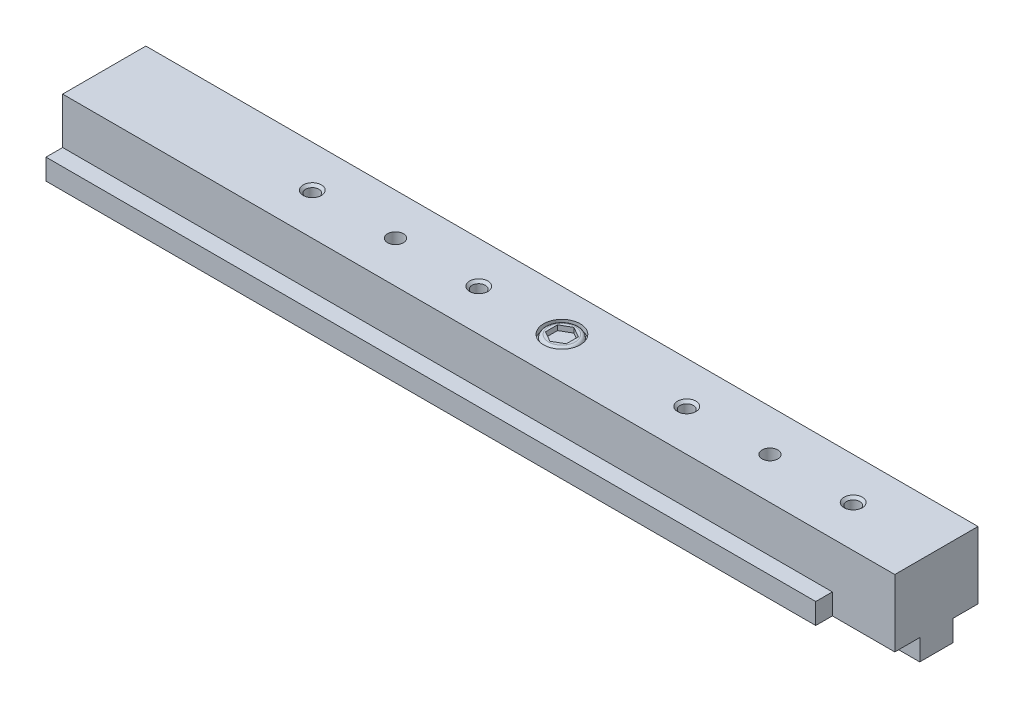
ISO-10303-21;
HEADER;
FILE_DESCRIPTION(('STEP AP214'),'2;1');
FILE_NAME('part.step','',(''),(''),'','','');
FILE_SCHEMA(('AUTOMOTIVE_DESIGN { 1 0 10303 214 1 1 1 1 }'));
ENDSEC;
DATA;
#1=APPLICATION_CONTEXT('core data for automotive mechanical design processes');
#2=APPLICATION_PROTOCOL_DEFINITION('international standard','automotive_design',2000,#1);
#3=PRODUCT_CONTEXT('',#1,'mechanical');
#4=PRODUCT('Part','Part','',(#3));
#5=PRODUCT_RELATED_PRODUCT_CATEGORY('part','',(#4));
#6=PRODUCT_DEFINITION_FORMATION('','',#4);
#7=PRODUCT_DEFINITION_CONTEXT('part definition',#1,'design');
#8=PRODUCT_DEFINITION('design','',#6,#7);
#9=PRODUCT_DEFINITION_SHAPE('','',#8);
#10=(LENGTH_UNIT() NAMED_UNIT(*) SI_UNIT(.MILLI.,.METRE.));
#11=(NAMED_UNIT(*) PLANE_ANGLE_UNIT() SI_UNIT($,.RADIAN.));
#12=(NAMED_UNIT(*) SI_UNIT($,.STERADIAN.) SOLID_ANGLE_UNIT());
#13=UNCERTAINTY_MEASURE_WITH_UNIT(LENGTH_MEASURE(1.E-05),#10,'distance_accuracy_value','');
#14=(GEOMETRIC_REPRESENTATION_CONTEXT(3) GLOBAL_UNCERTAINTY_ASSIGNED_CONTEXT((#13)) GLOBAL_UNIT_ASSIGNED_CONTEXT((#10,
#11,#12)) REPRESENTATION_CONTEXT('',''));
#15=CARTESIAN_POINT('',(0.,0.,0.));
#16=DIRECTION('',(0.,0.,1.));
#17=DIRECTION('',(1.,0.,0.));
#18=AXIS2_PLACEMENT_3D('',#15,#16,#17);
#19=CARTESIAN_POINT('',(69.85,12.7,0.));
#20=DIRECTION('',(0.,1.,0.));
#21=DIRECTION('',(0.,0.,1.));
#22=AXIS2_PLACEMENT_3D('',#19,#20,#21);
#23=PLANE('',#22);
#24=CARTESIAN_POINT('',(69.85,12.7,0.));
#25=DIRECTION('',(0.,1.,0.));
#26=DIRECTION('',(0.,0.,1.));
#27=AXIS2_PLACEMENT_3D('',#24,#25,#26);
#28=CIRCLE('',#27,2.794);
#29=CARTESIAN_POINT('',(69.85,12.7,2.794));
#30=VERTEX_POINT('',#29);
#31=EDGE_CURVE('E244',#30,#30,#28,.T.);
#32=ORIENTED_EDGE('',*,*,#31,.T.);
#33=EDGE_LOOP('',(#32));
#34=FACE_BOUND('',#33,.T.);
#35=CARTESIAN_POINT('',(69.85,12.7,0.));
#36=DIRECTION('',(0.,1.,0.));
#37=DIRECTION('',(0.,0.,1.));
#38=AXIS2_PLACEMENT_3D('',#35,#36,#37);
#39=CIRCLE('',#38,2.54);
#40=CARTESIAN_POINT('',(69.85,12.7,2.54));
#41=VERTEX_POINT('',#40);
#42=EDGE_CURVE('E37',#41,#41,#39,.F.);
#43=ORIENTED_EDGE('',*,*,#42,.T.);
#44=EDGE_LOOP('',(#43));
#45=FACE_BOUND('',#44,.T.);
#46=ADVANCED_FACE('F33',(#34,#45),#23,.T.);
#47=CARTESIAN_POINT('',(117.475,13.462,-6.35));
#48=DIRECTION('',(0.,-1.,0.));
#49=DIRECTION('',(0.,0.,-1.));
#50=AXIS2_PLACEMENT_3D('',#47,#48,#49);
#51=PLANE('',#50);
#52=CARTESIAN_POINT('',(69.85,13.462,0.));
#53=DIRECTION('',(0.,1.,0.));
#54=DIRECTION('',(0.,0.,1.));
#55=AXIS2_PLACEMENT_3D('',#52,#53,#54);
#56=CIRCLE('',#55,2.794);
#57=CARTESIAN_POINT('',(69.85,13.462,2.794));
#58=VERTEX_POINT('',#57);
#59=EDGE_CURVE('E248',#58,#58,#56,.T.);
#60=ORIENTED_EDGE('',*,*,#59,.F.);
#61=EDGE_LOOP('',(#60));
#62=FACE_BOUND('',#61,.T.);
#63=CARTESIAN_POINT('',(44.45,13.462,0.));
#64=DIRECTION('',(0.,1.,0.));
#65=DIRECTION('',(0.,0.,1.));
#66=AXIS2_PLACEMENT_3D('',#63,#64,#65);
#67=CIRCLE('',#66,1.20269);
#68=CARTESIAN_POINT('',(44.45,13.462,1.20269));
#69=VERTEX_POINT('',#68);
#70=EDGE_CURVE('E247',#69,#69,#67,.T.);
#71=ORIENTED_EDGE('',*,*,#70,.F.);
#72=EDGE_LOOP('',(#71));
#73=FACE_BOUND('',#72,.T.);
#74=CARTESIAN_POINT('',(101.6,13.462,0.));
#75=DIRECTION('',(0.,1.,0.));
#76=DIRECTION('',(0.,0.,1.));
#77=AXIS2_PLACEMENT_3D('',#74,#75,#76);
#78=CIRCLE('',#77,1.20269000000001);
#79=CARTESIAN_POINT('',(101.6,13.462,1.20269000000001));
#80=VERTEX_POINT('',#79);
#81=EDGE_CURVE('E254',#80,#80,#78,.T.);
#82=ORIENTED_EDGE('',*,*,#81,.F.);
#83=EDGE_LOOP('',(#82));
#84=FACE_BOUND('',#83,.T.);
#85=CARTESIAN_POINT('',(88.9,13.462,0.));
#86=DIRECTION('',(0.,1.,0.));
#87=DIRECTION('',(0.,0.,1.));
#88=AXIS2_PLACEMENT_3D('',#85,#86,#87);
#89=CIRCLE('',#88,1.397);
#90=CARTESIAN_POINT('',(88.9,13.462,1.397));
#91=VERTEX_POINT('',#90);
#92=EDGE_CURVE('E277',#91,#91,#89,.T.);
#93=ORIENTED_EDGE('',*,*,#92,.F.);
#94=EDGE_LOOP('',(#93));
#95=FACE_BOUND('',#94,.T.);
#96=CARTESIAN_POINT('',(114.3,13.462,0.));
#97=DIRECTION('',(0.,1.,0.));
#98=DIRECTION('',(0.,0.,1.));
#99=AXIS2_PLACEMENT_3D('',#96,#97,#98);
#100=CIRCLE('',#99,1.397);
#101=CARTESIAN_POINT('',(114.3,13.462,1.397));
#102=VERTEX_POINT('',#101);
#103=EDGE_CURVE('E295',#102,#102,#100,.T.);
#104=ORIENTED_EDGE('',*,*,#103,.F.);
#105=EDGE_LOOP('',(#104));
#106=FACE_BOUND('',#105,.T.);
#107=DIRECTION('',(0.,0.,1.));
#108=VECTOR('',#107,1.);
#109=CARTESIAN_POINT('',(0.,13.462,-6.35));
#110=LINE('',#109,#108);
#111=CARTESIAN_POINT('',(0.,13.462,-6.35));
#112=VERTEX_POINT('',#111);
#113=CARTESIAN_POINT('',(0.,13.462,6.35));
#114=VERTEX_POINT('',#113);
#115=EDGE_CURVE('E423',#112,#114,#110,.T.);
#116=ORIENTED_EDGE('',*,*,#115,.T.);
#117=DIRECTION('',(-1.,0.,0.));
#118=VECTOR('',#117,1.);
#119=CARTESIAN_POINT('',(117.475,13.462,6.35));
#120=LINE('',#119,#118);
#121=CARTESIAN_POINT('',(127.,13.462,6.35));
#122=VERTEX_POINT('',#121);
#123=EDGE_CURVE('E357',#122,#114,#120,.T.);
#124=ORIENTED_EDGE('',*,*,#123,.F.);
#125=DIRECTION('',(0.,0.,1.));
#126=VECTOR('',#125,1.);
#127=CARTESIAN_POINT('',(127.,13.462,-6.35));
#128=LINE('',#127,#126);
#129=CARTESIAN_POINT('',(127.,13.462,-6.35));
#130=VERTEX_POINT('',#129);
#131=EDGE_CURVE('E318',#130,#122,#128,.T.);
#132=ORIENTED_EDGE('',*,*,#131,.F.);
#133=DIRECTION('',(-1.,0.,0.));
#134=VECTOR('',#133,1.);
#135=CARTESIAN_POINT('',(117.475,13.462,-6.35));
#136=LINE('',#135,#134);
#137=EDGE_CURVE('E341',#130,#112,#136,.T.);
#138=ORIENTED_EDGE('',*,*,#137,.T.);
#139=EDGE_LOOP('',(#116,#124,#132,#138));
#140=FACE_BOUND('',#139,.T.);
#141=CARTESIAN_POINT('',(31.75,13.462,0.));
#142=DIRECTION('',(0.,1.,0.));
#143=DIRECTION('',(0.,0.,1.));
#144=AXIS2_PLACEMENT_3D('',#141,#142,#143);
#145=CIRCLE('',#144,1.397);
#146=CARTESIAN_POINT('',(31.75,13.462,1.397));
#147=VERTEX_POINT('',#146);
#148=EDGE_CURVE('E286',#147,#147,#145,.T.);
#149=ORIENTED_EDGE('',*,*,#148,.F.);
#150=EDGE_LOOP('',(#149));
#151=FACE_BOUND('',#150,.T.);
#152=CARTESIAN_POINT('',(57.15,13.462,0.));
#153=DIRECTION('',(0.,1.,0.));
#154=DIRECTION('',(0.,0.,1.));
#155=AXIS2_PLACEMENT_3D('',#152,#153,#154);
#156=CIRCLE('',#155,1.397);
#157=CARTESIAN_POINT('',(57.15,13.462,1.397));
#158=VERTEX_POINT('',#157);
#159=EDGE_CURVE('E268',#158,#158,#156,.T.);
#160=ORIENTED_EDGE('',*,*,#159,.F.);
#161=EDGE_LOOP('',(#160));
#162=FACE_BOUND('',#161,.T.);
#163=ADVANCED_FACE('F451',(#62,#73,#84,#95,#106,#140,#151,#162),#51,.F.);
#164=CARTESIAN_POINT('',(117.475,3.2258,8.89));
#165=DIRECTION('',(1.,0.,0.));
#166=DIRECTION('',(0.,0.,-1.));
#167=AXIS2_PLACEMENT_3D('',#164,#165,#166);
#168=PLANE('',#167);
#169=DIRECTION('',(0.,-1.,0.));
#170=VECTOR('',#169,1.);
#171=CARTESIAN_POINT('',(117.475,13.462,6.35));
#172=LINE('',#171,#170);
#173=CARTESIAN_POINT('',(117.475,6.4008,6.35));
#174=VERTEX_POINT('',#173);
#175=CARTESIAN_POINT('',(117.475,3.2258,6.35));
#176=VERTEX_POINT('',#175);
#177=EDGE_CURVE('E11',#174,#176,#172,.T.);
#178=ORIENTED_EDGE('',*,*,#177,.F.);
#179=DIRECTION('',(0.,0.,1.));
#180=VECTOR('',#179,1.);
#181=CARTESIAN_POINT('',(117.475,6.4008,6.35));
#182=LINE('',#181,#180);
#183=CARTESIAN_POINT('',(117.475,6.4008,8.89));
#184=VERTEX_POINT('',#183);
#185=EDGE_CURVE('E333',#174,#184,#182,.T.);
#186=ORIENTED_EDGE('',*,*,#185,.T.);
#187=DIRECTION('',(0.,-1.,0.));
#188=VECTOR('',#187,1.);
#189=CARTESIAN_POINT('',(117.475,6.4008,8.89));
#190=LINE('',#189,#188);
#191=CARTESIAN_POINT('',(117.475,3.2258,8.89));
#192=VERTEX_POINT('',#191);
#193=EDGE_CURVE('E400',#184,#192,#190,.T.);
#194=ORIENTED_EDGE('',*,*,#193,.T.);
#195=DIRECTION('',(0.,0.,-1.));
#196=VECTOR('',#195,1.);
#197=CARTESIAN_POINT('',(117.475,3.2258,8.89));
#198=LINE('',#197,#196);
#199=EDGE_CURVE('E398',#192,#176,#198,.T.);
#200=ORIENTED_EDGE('',*,*,#199,.T.);
#201=EDGE_LOOP('',(#178,#186,#194,#200));
#202=FACE_BOUND('',#201,.T.);
#203=ADVANCED_FACE('F431',(#202),#168,.T.);
#204=CARTESIAN_POINT('',(117.475,6.4008,8.89));
#205=DIRECTION('',(0.,0.,-1.));
#206=DIRECTION('',(-1.,0.,0.));
#207=AXIS2_PLACEMENT_3D('',#204,#205,#206);
#208=PLANE('',#207);
#209=DIRECTION('',(0.,-1.,0.));
#210=VECTOR('',#209,1.);
#211=CARTESIAN_POINT('',(0.,6.4008,8.89));
#212=LINE('',#211,#210);
#213=CARTESIAN_POINT('',(0.,6.4008,8.89));
#214=VERTEX_POINT('',#213);
#215=CARTESIAN_POINT('',(0.,3.2258,8.89));
#216=VERTEX_POINT('',#215);
#217=EDGE_CURVE('E351',#214,#216,#212,.T.);
#218=ORIENTED_EDGE('',*,*,#217,.T.);
#219=DIRECTION('',(-1.,0.,0.));
#220=VECTOR('',#219,1.);
#221=CARTESIAN_POINT('',(117.475,3.2258,8.89));
#222=LINE('',#221,#220);
#223=EDGE_CURVE('E42',#192,#216,#222,.T.);
#224=ORIENTED_EDGE('',*,*,#223,.F.);
#225=ORIENTED_EDGE('',*,*,#193,.F.);
#226=DIRECTION('',(-1.,0.,0.));
#227=VECTOR('',#226,1.);
#228=CARTESIAN_POINT('',(117.475,6.4008,8.89));
#229=LINE('',#228,#227);
#230=EDGE_CURVE('E358',#184,#214,#229,.T.);
#231=ORIENTED_EDGE('',*,*,#230,.T.);
#232=EDGE_LOOP('',(#218,#224,#225,#231));
#233=FACE_BOUND('',#232,.T.);
#234=ADVANCED_FACE('F35',(#233),#208,.F.);
#235=CARTESIAN_POINT('',(117.475,3.2258,8.89));
#236=DIRECTION('',(0.,1.,0.));
#237=DIRECTION('',(0.,0.,1.));
#238=AXIS2_PLACEMENT_3D('',#235,#236,#237);
#239=PLANE('',#238);
#240=DIRECTION('',(0.,0.,-1.));
#241=VECTOR('',#240,1.);
#242=CARTESIAN_POINT('',(0.,3.2258,8.89));
#243=LINE('',#242,#241);
#244=CARTESIAN_POINT('',(0.,3.2258,2.54));
#245=VERTEX_POINT('',#244);
#246=EDGE_CURVE('E407',#216,#245,#243,.T.);
#247=ORIENTED_EDGE('',*,*,#246,.T.);
#248=DIRECTION('',(-1.,0.,0.));
#249=VECTOR('',#248,1.);
#250=CARTESIAN_POINT('',(117.475,3.2258,2.54));
#251=LINE('',#250,#249);
#252=CARTESIAN_POINT('',(127.,3.2258,2.54));
#253=VERTEX_POINT('',#252);
#254=EDGE_CURVE('E394',#253,#245,#251,.T.);
#255=ORIENTED_EDGE('',*,*,#254,.F.);
#256=DIRECTION('',(0.,0.,-1.));
#257=VECTOR('',#256,1.);
#258=CARTESIAN_POINT('',(127.,3.2258,6.35));
#259=LINE('',#258,#257);
#260=CARTESIAN_POINT('',(127.,3.2258,6.35));
#261=VERTEX_POINT('',#260);
#262=EDGE_CURVE('E301',#261,#253,#259,.T.);
#263=ORIENTED_EDGE('',*,*,#262,.F.);
#264=DIRECTION('',(-1.,0.,0.));
#265=VECTOR('',#264,1.);
#266=CARTESIAN_POINT('',(127.,3.2258,6.35));
#267=LINE('',#266,#265);
#268=EDGE_CURVE('E346',#261,#176,#267,.T.);
#269=ORIENTED_EDGE('',*,*,#268,.T.);
#270=ORIENTED_EDGE('',*,*,#199,.F.);
#271=ORIENTED_EDGE('',*,*,#223,.T.);
#272=EDGE_LOOP('',(#247,#255,#263,#269,#270,#271));
#273=FACE_BOUND('',#272,.T.);
#274=ADVANCED_FACE('F433',(#273),#239,.F.);
#275=CARTESIAN_POINT('',(117.475,3.2258,2.54));
#276=DIRECTION('',(0.,0.,-1.));
#277=DIRECTION('',(-1.,0.,0.));
#278=AXIS2_PLACEMENT_3D('',#275,#276,#277);
#279=PLANE('',#278);
#280=DIRECTION('',(0.,-1.,0.));
#281=VECTOR('',#280,1.);
#282=CARTESIAN_POINT('',(0.,3.2258,2.54));
#283=LINE('',#282,#281);
#284=CARTESIAN_POINT('',(0.,0.,2.54));
#285=VERTEX_POINT('',#284);
#286=EDGE_CURVE('E409',#245,#285,#283,.T.);
#287=ORIENTED_EDGE('',*,*,#286,.T.);
#288=DIRECTION('',(-1.,0.,0.));
#289=VECTOR('',#288,1.);
#290=CARTESIAN_POINT('',(117.475,0.,2.54));
#291=LINE('',#290,#289);
#292=CARTESIAN_POINT('',(127.,0.,2.54));
#293=VERTEX_POINT('',#292);
#294=EDGE_CURVE('E391',#293,#285,#291,.T.);
#295=ORIENTED_EDGE('',*,*,#294,.F.);
#296=DIRECTION('',(0.,-1.,0.));
#297=VECTOR('',#296,1.);
#298=CARTESIAN_POINT('',(127.,3.2258,2.54));
#299=LINE('',#298,#297);
#300=EDGE_CURVE('E304',#253,#293,#299,.T.);
#301=ORIENTED_EDGE('',*,*,#300,.F.);
#302=ORIENTED_EDGE('',*,*,#254,.T.);
#303=EDGE_LOOP('',(#287,#295,#301,#302));
#304=FACE_BOUND('',#303,.T.);
#305=ADVANCED_FACE('F543',(#304),#279,.F.);
#306=CARTESIAN_POINT('',(117.475,0.,2.54));
#307=DIRECTION('',(0.,1.,0.));
#308=DIRECTION('',(0.,0.,1.));
#309=AXIS2_PLACEMENT_3D('',#306,#307,#308);
#310=PLANE('',#309);
#311=DIRECTION('',(0.,0.,-1.));
#312=VECTOR('',#311,1.);
#313=CARTESIAN_POINT('',(0.,0.,2.54));
#314=LINE('',#313,#312);
#315=CARTESIAN_POINT('',(0.,0.,-2.54));
#316=VERTEX_POINT('',#315);
#317=EDGE_CURVE('E411',#285,#316,#314,.T.);
#318=ORIENTED_EDGE('',*,*,#317,.T.);
#319=DIRECTION('',(-1.,0.,0.));
#320=VECTOR('',#319,1.);
#321=CARTESIAN_POINT('',(117.475,0.,-2.54));
#322=LINE('',#321,#320);
#323=CARTESIAN_POINT('',(127.,0.,-2.54));
#324=VERTEX_POINT('',#323);
#325=EDGE_CURVE('E388',#324,#316,#322,.T.);
#326=ORIENTED_EDGE('',*,*,#325,.F.);
#327=DIRECTION('',(0.,0.,-1.));
#328=VECTOR('',#327,1.);
#329=CARTESIAN_POINT('',(127.,0.,2.54));
#330=LINE('',#329,#328);
#331=EDGE_CURVE('E307',#293,#324,#330,.T.);
#332=ORIENTED_EDGE('',*,*,#331,.F.);
#333=ORIENTED_EDGE('',*,*,#294,.T.);
#334=EDGE_LOOP('',(#318,#326,#332,#333));
#335=FACE_BOUND('',#334,.T.);
#336=ADVANCED_FACE('F547',(#335),#310,.F.);
#337=CARTESIAN_POINT('',(117.475,0.,-2.54));
#338=DIRECTION('',(0.,0.,1.));
#339=DIRECTION('',(1.,0.,0.));
#340=AXIS2_PLACEMENT_3D('',#337,#338,#339);
#341=PLANE('',#340);
#342=DIRECTION('',(0.,1.,0.));
#343=VECTOR('',#342,1.);
#344=CARTESIAN_POINT('',(0.,0.,-2.54));
#345=LINE('',#344,#343);
#346=CARTESIAN_POINT('',(0.,3.2258,-2.54));
#347=VERTEX_POINT('',#346);
#348=EDGE_CURVE('E413',#316,#347,#345,.T.);
#349=ORIENTED_EDGE('',*,*,#348,.T.);
#350=DIRECTION('',(-1.,0.,0.));
#351=VECTOR('',#350,1.);
#352=CARTESIAN_POINT('',(117.475,3.2258,-2.54));
#353=LINE('',#352,#351);
#354=CARTESIAN_POINT('',(127.,3.2258,-2.54));
#355=VERTEX_POINT('',#354);
#356=EDGE_CURVE('E385',#355,#347,#353,.T.);
#357=ORIENTED_EDGE('',*,*,#356,.F.);
#358=DIRECTION('',(0.,1.,0.));
#359=VECTOR('',#358,1.);
#360=CARTESIAN_POINT('',(127.,0.,-2.54));
#361=LINE('',#360,#359);
#362=EDGE_CURVE('E310',#324,#355,#361,.T.);
#363=ORIENTED_EDGE('',*,*,#362,.F.);
#364=ORIENTED_EDGE('',*,*,#325,.T.);
#365=EDGE_LOOP('',(#349,#357,#363,#364));
#366=FACE_BOUND('',#365,.T.);
#367=ADVANCED_FACE('F551',(#366),#341,.F.);
#368=CARTESIAN_POINT('',(117.475,3.2258,-2.54));
#369=DIRECTION('',(0.,1.,0.));
#370=DIRECTION('',(0.,0.,1.));
#371=AXIS2_PLACEMENT_3D('',#368,#369,#370);
#372=PLANE('',#371);
#373=DIRECTION('',(0.,0.,-1.));
#374=VECTOR('',#373,1.);
#375=CARTESIAN_POINT('',(0.,3.2258,-2.54));
#376=LINE('',#375,#374);
#377=CARTESIAN_POINT('',(0.,3.2258,-8.89));
#378=VERTEX_POINT('',#377);
#379=EDGE_CURVE('E415',#347,#378,#376,.T.);
#380=ORIENTED_EDGE('',*,*,#379,.T.);
#381=DIRECTION('',(-1.,0.,0.));
#382=VECTOR('',#381,1.);
#383=CARTESIAN_POINT('',(117.475,3.2258,-8.89));
#384=LINE('',#383,#382);
#385=CARTESIAN_POINT('',(117.475,3.2258,-8.89));
#386=VERTEX_POINT('',#385);
#387=EDGE_CURVE('E382',#386,#378,#384,.T.);
#388=ORIENTED_EDGE('',*,*,#387,.F.);
#389=DIRECTION('',(0.,0.,-1.));
#390=VECTOR('',#389,1.);
#391=CARTESIAN_POINT('',(117.475,3.2258,-2.54));
#392=LINE('',#391,#390);
#393=CARTESIAN_POINT('',(117.475,3.2258,-6.35));
#394=VERTEX_POINT('',#393);
#395=EDGE_CURVE('E328',#394,#386,#392,.T.);
#396=ORIENTED_EDGE('',*,*,#395,.F.);
#397=DIRECTION('',(-1.,0.,0.));
#398=VECTOR('',#397,1.);
#399=CARTESIAN_POINT('',(127.,3.2258,-6.35));
#400=LINE('',#399,#398);
#401=CARTESIAN_POINT('',(127.,3.2258,-6.35));
#402=VERTEX_POINT('',#401);
#403=EDGE_CURVE('E321',#402,#394,#400,.T.);
#404=ORIENTED_EDGE('',*,*,#403,.F.);
#405=DIRECTION('',(0.,0.,-1.));
#406=VECTOR('',#405,1.);
#407=CARTESIAN_POINT('',(127.,3.2258,-2.54));
#408=LINE('',#407,#406);
#409=EDGE_CURVE('E313',#355,#402,#408,.T.);
#410=ORIENTED_EDGE('',*,*,#409,.F.);
#411=ORIENTED_EDGE('',*,*,#356,.T.);
#412=EDGE_LOOP('',(#380,#388,#396,#404,#410,#411));
#413=FACE_BOUND('',#412,.T.);
#414=ADVANCED_FACE('F554',(#413),#372,.F.);
#415=CARTESIAN_POINT('',(117.475,3.2258,-8.89));
#416=DIRECTION('',(0.,0.,1.));
#417=DIRECTION('',(1.,0.,0.));
#418=AXIS2_PLACEMENT_3D('',#415,#416,#417);
#419=PLANE('',#418);
#420=DIRECTION('',(0.,1.,0.));
#421=VECTOR('',#420,1.);
#422=CARTESIAN_POINT('',(0.,3.2258,-8.89));
#423=LINE('',#422,#421);
#424=CARTESIAN_POINT('',(0.,6.4008,-8.89));
#425=VERTEX_POINT('',#424);
#426=EDGE_CURVE('E417',#378,#425,#423,.T.);
#427=ORIENTED_EDGE('',*,*,#426,.T.);
#428=DIRECTION('',(-1.,0.,0.));
#429=VECTOR('',#428,1.);
#430=CARTESIAN_POINT('',(117.475,6.4008,-8.89));
#431=LINE('',#430,#429);
#432=CARTESIAN_POINT('',(117.475,6.4008,-8.89));
#433=VERTEX_POINT('',#432);
#434=EDGE_CURVE('E340',#433,#425,#431,.T.);
#435=ORIENTED_EDGE('',*,*,#434,.F.);
#436=DIRECTION('',(0.,1.,0.));
#437=VECTOR('',#436,1.);
#438=CARTESIAN_POINT('',(117.475,3.2258,-8.89));
#439=LINE('',#438,#437);
#440=EDGE_CURVE('E334',#386,#433,#439,.T.);
#441=ORIENTED_EDGE('',*,*,#440,.F.);
#442=ORIENTED_EDGE('',*,*,#387,.T.);
#443=EDGE_LOOP('',(#427,#435,#441,#442));
#444=FACE_BOUND('',#443,.T.);
#445=ADVANCED_FACE('F562',(#444),#419,.F.);
#446=CARTESIAN_POINT('',(117.475,6.4008,-8.89));
#447=DIRECTION('',(0.,-1.,0.));
#448=DIRECTION('',(0.,0.,-1.));
#449=AXIS2_PLACEMENT_3D('',#446,#447,#448);
#450=PLANE('',#449);
#451=DIRECTION('',(0.,0.,1.));
#452=VECTOR('',#451,1.);
#453=CARTESIAN_POINT('',(0.,6.4008,-8.89));
#454=LINE('',#453,#452);
#455=CARTESIAN_POINT('',(0.,6.4008,-6.35));
#456=VERTEX_POINT('',#455);
#457=EDGE_CURVE('E419',#425,#456,#454,.T.);
#458=ORIENTED_EDGE('',*,*,#457,.T.);
#459=DIRECTION('',(-1.,0.,0.));
#460=VECTOR('',#459,1.);
#461=CARTESIAN_POINT('',(117.475,6.4008,-6.35));
#462=LINE('',#461,#460);
#463=CARTESIAN_POINT('',(117.475,6.4008,-6.35));
#464=VERTEX_POINT('',#463);
#465=EDGE_CURVE('E337',#464,#456,#462,.T.);
#466=ORIENTED_EDGE('',*,*,#465,.F.);
#467=DIRECTION('',(0.,0.,1.));
#468=VECTOR('',#467,1.);
#469=CARTESIAN_POINT('',(117.475,6.4008,-8.89));
#470=LINE('',#469,#468);
#471=EDGE_CURVE('E331',#433,#464,#470,.T.);
#472=ORIENTED_EDGE('',*,*,#471,.F.);
#473=ORIENTED_EDGE('',*,*,#434,.T.);
#474=EDGE_LOOP('',(#458,#466,#472,#473));
#475=FACE_BOUND('',#474,.T.);
#476=ADVANCED_FACE('F566',(#475),#450,.F.);
#477=CARTESIAN_POINT('',(117.475,6.4008,-6.35));
#478=DIRECTION('',(0.,0.,1.));
#479=DIRECTION('',(1.,0.,0.));
#480=AXIS2_PLACEMENT_3D('',#477,#478,#479);
#481=PLANE('',#480);
#482=DIRECTION('',(0.,1.,0.));
#483=VECTOR('',#482,1.);
#484=CARTESIAN_POINT('',(0.,6.4008,-6.35));
#485=LINE('',#484,#483);
#486=EDGE_CURVE('E421',#456,#112,#485,.T.);
#487=ORIENTED_EDGE('',*,*,#486,.T.);
#488=ORIENTED_EDGE('',*,*,#137,.F.);
#489=DIRECTION('',(0.,1.,0.));
#490=VECTOR('',#489,1.);
#491=CARTESIAN_POINT('',(127.,3.2258,-6.35));
#492=LINE('',#491,#490);
#493=EDGE_CURVE('E315',#402,#130,#492,.T.);
#494=ORIENTED_EDGE('',*,*,#493,.F.);
#495=ORIENTED_EDGE('',*,*,#403,.T.);
#496=DIRECTION('',(0.,1.,0.));
#497=VECTOR('',#496,1.);
#498=CARTESIAN_POINT('',(117.475,3.2258,-6.35));
#499=LINE('',#498,#497);
#500=EDGE_CURVE('E58',#394,#464,#499,.T.);
#501=ORIENTED_EDGE('',*,*,#500,.T.);
#502=ORIENTED_EDGE('',*,*,#465,.T.);
#503=EDGE_LOOP('',(#487,#488,#494,#495,#501,#502));
#504=FACE_BOUND('',#503,.T.);
#505=ADVANCED_FACE('F447',(#504),#481,.F.);
#506=CARTESIAN_POINT('',(117.475,13.462,6.35));
#507=DIRECTION('',(0.,0.,-1.));
#508=DIRECTION('',(-1.,0.,0.));
#509=AXIS2_PLACEMENT_3D('',#506,#507,#508);
#510=PLANE('',#509);
#511=DIRECTION('',(0.,-1.,0.));
#512=VECTOR('',#511,1.);
#513=CARTESIAN_POINT('',(0.,13.462,6.35));
#514=LINE('',#513,#512);
#515=CARTESIAN_POINT('',(0.,6.4008,6.35));
#516=VERTEX_POINT('',#515);
#517=EDGE_CURVE('E424',#114,#516,#514,.T.);
#518=ORIENTED_EDGE('',*,*,#517,.T.);
#519=DIRECTION('',(-1.,0.,0.));
#520=VECTOR('',#519,1.);
#521=CARTESIAN_POINT('',(117.475,6.4008,6.35));
#522=LINE('',#521,#520);
#523=EDGE_CURVE('E354',#174,#516,#522,.T.);
#524=ORIENTED_EDGE('',*,*,#523,.F.);
#525=ORIENTED_EDGE('',*,*,#177,.T.);
#526=ORIENTED_EDGE('',*,*,#268,.F.);
#527=DIRECTION('',(0.,-1.,0.));
#528=VECTOR('',#527,1.);
#529=CARTESIAN_POINT('',(127.,13.462,6.35));
#530=LINE('',#529,#528);
#531=EDGE_CURVE('E298',#122,#261,#530,.T.);
#532=ORIENTED_EDGE('',*,*,#531,.F.);
#533=ORIENTED_EDGE('',*,*,#123,.T.);
#534=EDGE_LOOP('',(#518,#524,#525,#526,#532,#533));
#535=FACE_BOUND('',#534,.T.);
#536=ADVANCED_FACE('F436',(#535),#510,.F.);
#537=CARTESIAN_POINT('',(117.475,6.4008,6.35));
#538=DIRECTION('',(0.,-1.,0.));
#539=DIRECTION('',(0.,0.,-1.));
#540=AXIS2_PLACEMENT_3D('',#537,#538,#539);
#541=PLANE('',#540);
#542=DIRECTION('',(0.,0.,1.));
#543=VECTOR('',#542,1.);
#544=CARTESIAN_POINT('',(0.,6.4008,6.35));
#545=LINE('',#544,#543);
#546=EDGE_CURVE('E374',#516,#214,#545,.T.);
#547=ORIENTED_EDGE('',*,*,#546,.T.);
#548=ORIENTED_EDGE('',*,*,#230,.F.);
#549=ORIENTED_EDGE('',*,*,#185,.F.);
#550=ORIENTED_EDGE('',*,*,#523,.T.);
#551=EDGE_LOOP('',(#547,#548,#549,#550));
#552=FACE_BOUND('',#551,.T.);
#553=ADVANCED_FACE('F437',(#552),#541,.F.);
#554=ORIENTED_EDGE('',*,*,#500,.F.);
#555=ORIENTED_EDGE('',*,*,#395,.T.);
#556=ORIENTED_EDGE('',*,*,#440,.T.);
#557=ORIENTED_EDGE('',*,*,#471,.T.);
#558=EDGE_LOOP('',(#554,#555,#556,#557));
#559=FACE_BOUND('',#558,.T.);
#560=ADVANCED_FACE('F439',(#559),#168,.T.);
#561=CARTESIAN_POINT('',(0.,3.2258,8.89));
#562=DIRECTION('',(1.,0.,0.));
#563=DIRECTION('',(0.,0.,-1.));
#564=AXIS2_PLACEMENT_3D('',#561,#562,#563);
#565=PLANE('',#564);
#566=ORIENTED_EDGE('',*,*,#217,.F.);
#567=ORIENTED_EDGE('',*,*,#546,.F.);
#568=ORIENTED_EDGE('',*,*,#517,.F.);
#569=ORIENTED_EDGE('',*,*,#115,.F.);
#570=ORIENTED_EDGE('',*,*,#486,.F.);
#571=ORIENTED_EDGE('',*,*,#457,.F.);
#572=ORIENTED_EDGE('',*,*,#426,.F.);
#573=ORIENTED_EDGE('',*,*,#379,.F.);
#574=ORIENTED_EDGE('',*,*,#348,.F.);
#575=ORIENTED_EDGE('',*,*,#317,.F.);
#576=ORIENTED_EDGE('',*,*,#286,.F.);
#577=ORIENTED_EDGE('',*,*,#246,.F.);
#578=EDGE_LOOP('',(#566,#567,#568,#569,#570,#571,#572,#573,#574,#575,#576,#577));
#579=FACE_BOUND('',#578,.T.);
#580=ADVANCED_FACE('F445',(#579),#565,.F.);
#581=CARTESIAN_POINT('',(127.,3.2258,6.35));
#582=DIRECTION('',(1.,0.,0.));
#583=DIRECTION('',(0.,0.,-1.));
#584=AXIS2_PLACEMENT_3D('',#581,#582,#583);
#585=PLANE('',#584);
#586=ORIENTED_EDGE('',*,*,#531,.T.);
#587=ORIENTED_EDGE('',*,*,#262,.T.);
#588=ORIENTED_EDGE('',*,*,#300,.T.);
#589=ORIENTED_EDGE('',*,*,#331,.T.);
#590=ORIENTED_EDGE('',*,*,#362,.T.);
#591=ORIENTED_EDGE('',*,*,#409,.T.);
#592=ORIENTED_EDGE('',*,*,#493,.T.);
#593=ORIENTED_EDGE('',*,*,#131,.T.);
#594=EDGE_LOOP('',(#586,#587,#588,#589,#590,#591,#592,#593));
#595=FACE_BOUND('',#594,.T.);
#596=ADVANCED_FACE('F531',(#595),#585,.T.);
#597=CARTESIAN_POINT('',(114.3,13.081,0.));
#598=DIRECTION('',(0.,1.,0.));
#599=DIRECTION('',(0.,0.,1.));
#600=AXIS2_PLACEMENT_3D('',#597,#598,#599);
#601=CONICAL_SURFACE('',#600,1.016,0.785398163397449);
#602=ORIENTED_EDGE('',*,*,#103,.T.);
#603=EDGE_LOOP('',(#602));
#604=FACE_BOUND('',#603,.T.);
#605=CARTESIAN_POINT('',(114.3,13.081,0.));
#606=DIRECTION('',(0.,1.,0.));
#607=DIRECTION('',(0.,0.,1.));
#608=AXIS2_PLACEMENT_3D('',#605,#606,#607);
#609=CIRCLE('',#608,1.016);
#610=CARTESIAN_POINT('',(114.3,13.081,1.016));
#611=VERTEX_POINT('',#610);
#612=EDGE_CURVE('E292',#611,#611,#609,.T.);
#613=ORIENTED_EDGE('',*,*,#612,.F.);
#614=EDGE_LOOP('',(#613));
#615=FACE_BOUND('',#614,.T.);
#616=ADVANCED_FACE('F527',(#604,#615),#601,.F.);
#617=CARTESIAN_POINT('',(114.3,5.207,0.));
#618=DIRECTION('',(0.,1.,0.));
#619=DIRECTION('',(0.,0.,1.));
#620=AXIS2_PLACEMENT_3D('',#617,#618,#619);
#621=CYLINDRICAL_SURFACE('',#620,1.016);
#622=ORIENTED_EDGE('',*,*,#612,.T.);
#623=EDGE_LOOP('',(#622));
#624=FACE_BOUND('',#623,.T.);
#625=CARTESIAN_POINT('',(114.3,5.7935878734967,0.));
#626=DIRECTION('',(0.,1.,0.));
#627=DIRECTION('',(0.,0.,1.));
#628=AXIS2_PLACEMENT_3D('',#625,#626,#627);
#629=CIRCLE('',#628,1.016);
#630=CARTESIAN_POINT('',(114.3,5.7935878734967,1.016));
#631=VERTEX_POINT('',#630);
#632=EDGE_CURVE('E289',#631,#631,#629,.T.);
#633=ORIENTED_EDGE('',*,*,#632,.F.);
#634=EDGE_LOOP('',(#633));
#635=FACE_BOUND('',#634,.T.);
#636=ADVANCED_FACE('F523',(#624,#635),#621,.F.);
#637=CARTESIAN_POINT('',(114.3,5.207,0.));
#638=DIRECTION('',(0.,1.,0.));
#639=DIRECTION('',(0.,0.,1.));
#640=AXIS2_PLACEMENT_3D('',#637,#638,#639);
#641=CONICAL_SURFACE('',#640,0.,1.04719755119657);
#642=ORIENTED_EDGE('',*,*,#632,.T.);
#643=EDGE_LOOP('',(#642));
#644=FACE_BOUND('',#643,.T.);
#645=CARTESIAN_POINT('',(114.3,5.207,0.));
#646=VERTEX_POINT('',#645);
#647=VERTEX_LOOP('',#646);
#648=FACE_BOUND('',#647,.T.);
#649=ADVANCED_FACE('F519',(#644,#648),#641,.F.);
#650=CARTESIAN_POINT('',(31.75,13.081,0.));
#651=DIRECTION('',(0.,1.,0.));
#652=DIRECTION('',(0.,0.,1.));
#653=AXIS2_PLACEMENT_3D('',#650,#651,#652);
#654=CONICAL_SURFACE('',#653,1.016,0.785398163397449);
#655=ORIENTED_EDGE('',*,*,#148,.T.);
#656=EDGE_LOOP('',(#655));
#657=FACE_BOUND('',#656,.T.);
#658=CARTESIAN_POINT('',(31.75,13.081,0.));
#659=DIRECTION('',(0.,1.,0.));
#660=DIRECTION('',(0.,0.,1.));
#661=AXIS2_PLACEMENT_3D('',#658,#659,#660);
#662=CIRCLE('',#661,1.016);
#663=CARTESIAN_POINT('',(31.75,13.081,1.016));
#664=VERTEX_POINT('',#663);
#665=EDGE_CURVE('E283',#664,#664,#662,.T.);
#666=ORIENTED_EDGE('',*,*,#665,.F.);
#667=EDGE_LOOP('',(#666));
#668=FACE_BOUND('',#667,.T.);
#669=ADVANCED_FACE('F515',(#657,#668),#654,.F.);
#670=CARTESIAN_POINT('',(31.75,7.112,0.));
#671=DIRECTION('',(0.,1.,0.));
#672=DIRECTION('',(0.,0.,1.));
#673=AXIS2_PLACEMENT_3D('',#670,#671,#672);
#674=CYLINDRICAL_SURFACE('',#673,1.016);
#675=ORIENTED_EDGE('',*,*,#665,.T.);
#676=EDGE_LOOP('',(#675));
#677=FACE_BOUND('',#676,.T.);
#678=CARTESIAN_POINT('',(31.75,7.6985878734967,0.));
#679=DIRECTION('',(0.,1.,0.));
#680=DIRECTION('',(0.,0.,1.));
#681=AXIS2_PLACEMENT_3D('',#678,#679,#680);
#682=CIRCLE('',#681,1.016);
#683=CARTESIAN_POINT('',(31.75,7.6985878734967,1.016));
#684=VERTEX_POINT('',#683);
#685=EDGE_CURVE('E280',#684,#684,#682,.T.);
#686=ORIENTED_EDGE('',*,*,#685,.F.);
#687=EDGE_LOOP('',(#686));
#688=FACE_BOUND('',#687,.T.);
#689=ADVANCED_FACE('F511',(#677,#688),#674,.F.);
#690=CARTESIAN_POINT('',(31.75,7.112,0.));
#691=DIRECTION('',(0.,1.,0.));
#692=DIRECTION('',(0.,0.,1.));
#693=AXIS2_PLACEMENT_3D('',#690,#691,#692);
#694=CONICAL_SURFACE('',#693,0.,1.04719755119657);
#695=ORIENTED_EDGE('',*,*,#685,.T.);
#696=EDGE_LOOP('',(#695));
#697=FACE_BOUND('',#696,.T.);
#698=CARTESIAN_POINT('',(31.75,7.112,0.));
#699=VERTEX_POINT('',#698);
#700=VERTEX_LOOP('',#699);
#701=FACE_BOUND('',#700,.T.);
#702=ADVANCED_FACE('F507',(#697,#701),#694,.F.);
#703=CARTESIAN_POINT('',(88.9,13.081,0.));
#704=DIRECTION('',(0.,1.,0.));
#705=DIRECTION('',(0.,0.,1.));
#706=AXIS2_PLACEMENT_3D('',#703,#704,#705);
#707=CONICAL_SURFACE('',#706,1.016,0.785398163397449);
#708=ORIENTED_EDGE('',*,*,#92,.T.);
#709=EDGE_LOOP('',(#708));
#710=FACE_BOUND('',#709,.T.);
#711=CARTESIAN_POINT('',(88.9,13.081,0.));
#712=DIRECTION('',(0.,1.,0.));
#713=DIRECTION('',(0.,0.,1.));
#714=AXIS2_PLACEMENT_3D('',#711,#712,#713);
#715=CIRCLE('',#714,1.016);
#716=CARTESIAN_POINT('',(88.9,13.081,1.016));
#717=VERTEX_POINT('',#716);
#718=EDGE_CURVE('E274',#717,#717,#715,.T.);
#719=ORIENTED_EDGE('',*,*,#718,.F.);
#720=EDGE_LOOP('',(#719));
#721=FACE_BOUND('',#720,.T.);
#722=ADVANCED_FACE('F503',(#710,#721),#707,.F.);
#723=CARTESIAN_POINT('',(88.9,5.207,0.));
#724=DIRECTION('',(0.,1.,0.));
#725=DIRECTION('',(0.,0.,1.));
#726=AXIS2_PLACEMENT_3D('',#723,#724,#725);
#727=CYLINDRICAL_SURFACE('',#726,1.016);
#728=ORIENTED_EDGE('',*,*,#718,.T.);
#729=EDGE_LOOP('',(#728));
#730=FACE_BOUND('',#729,.T.);
#731=CARTESIAN_POINT('',(88.9,5.7935878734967,0.));
#732=DIRECTION('',(0.,1.,0.));
#733=DIRECTION('',(0.,0.,1.));
#734=AXIS2_PLACEMENT_3D('',#731,#732,#733);
#735=CIRCLE('',#734,1.016);
#736=CARTESIAN_POINT('',(88.9,5.7935878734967,1.016));
#737=VERTEX_POINT('',#736);
#738=EDGE_CURVE('E271',#737,#737,#735,.T.);
#739=ORIENTED_EDGE('',*,*,#738,.F.);
#740=EDGE_LOOP('',(#739));
#741=FACE_BOUND('',#740,.T.);
#742=ADVANCED_FACE('F499',(#730,#741),#727,.F.);
#743=CARTESIAN_POINT('',(88.9,5.207,0.));
#744=DIRECTION('',(0.,1.,0.));
#745=DIRECTION('',(0.,0.,1.));
#746=AXIS2_PLACEMENT_3D('',#743,#744,#745);
#747=CONICAL_SURFACE('',#746,0.,1.04719755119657);
#748=ORIENTED_EDGE('',*,*,#738,.T.);
#749=EDGE_LOOP('',(#748));
#750=FACE_BOUND('',#749,.T.);
#751=CARTESIAN_POINT('',(88.9,5.207,0.));
#752=VERTEX_POINT('',#751);
#753=VERTEX_LOOP('',#752);
#754=FACE_BOUND('',#753,.T.);
#755=ADVANCED_FACE('F495',(#750,#754),#747,.F.);
#756=CARTESIAN_POINT('',(57.15,13.081,0.));
#757=DIRECTION('',(0.,1.,0.));
#758=DIRECTION('',(0.,0.,1.));
#759=AXIS2_PLACEMENT_3D('',#756,#757,#758);
#760=CONICAL_SURFACE('',#759,1.016,0.785398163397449);
#761=ORIENTED_EDGE('',*,*,#159,.T.);
#762=EDGE_LOOP('',(#761));
#763=FACE_BOUND('',#762,.T.);
#764=CARTESIAN_POINT('',(57.15,13.081,0.));
#765=DIRECTION('',(0.,1.,0.));
#766=DIRECTION('',(0.,0.,1.));
#767=AXIS2_PLACEMENT_3D('',#764,#765,#766);
#768=CIRCLE('',#767,1.016);
#769=CARTESIAN_POINT('',(57.15,13.081,1.016));
#770=VERTEX_POINT('',#769);
#771=EDGE_CURVE('E265',#770,#770,#768,.T.);
#772=ORIENTED_EDGE('',*,*,#771,.F.);
#773=EDGE_LOOP('',(#772));
#774=FACE_BOUND('',#773,.T.);
#775=ADVANCED_FACE('F491',(#763,#774),#760,.F.);
#776=CARTESIAN_POINT('',(57.15,5.207,0.));
#777=DIRECTION('',(0.,1.,0.));
#778=DIRECTION('',(0.,0.,1.));
#779=AXIS2_PLACEMENT_3D('',#776,#777,#778);
#780=CYLINDRICAL_SURFACE('',#779,1.016);
#781=ORIENTED_EDGE('',*,*,#771,.T.);
#782=EDGE_LOOP('',(#781));
#783=FACE_BOUND('',#782,.T.);
#784=CARTESIAN_POINT('',(57.15,5.7935878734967,0.));
#785=DIRECTION('',(0.,1.,0.));
#786=DIRECTION('',(0.,0.,1.));
#787=AXIS2_PLACEMENT_3D('',#784,#785,#786);
#788=CIRCLE('',#787,1.016);
#789=CARTESIAN_POINT('',(57.15,5.7935878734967,1.016));
#790=VERTEX_POINT('',#789);
#791=EDGE_CURVE('E260',#790,#790,#788,.T.);
#792=ORIENTED_EDGE('',*,*,#791,.F.);
#793=EDGE_LOOP('',(#792));
#794=FACE_BOUND('',#793,.T.);
#795=ADVANCED_FACE('F487',(#783,#794),#780,.F.);
#796=CARTESIAN_POINT('',(57.15,5.207,0.));
#797=DIRECTION('',(0.,1.,0.));
#798=DIRECTION('',(0.,0.,1.));
#799=AXIS2_PLACEMENT_3D('',#796,#797,#798);
#800=CONICAL_SURFACE('',#799,0.,1.04719755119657);
#801=ORIENTED_EDGE('',*,*,#791,.T.);
#802=EDGE_LOOP('',(#801));
#803=FACE_BOUND('',#802,.T.);
#804=CARTESIAN_POINT('',(57.15,5.207,0.));
#805=VERTEX_POINT('',#804);
#806=VERTEX_LOOP('',#805);
#807=FACE_BOUND('',#806,.T.);
#808=ADVANCED_FACE('F483',(#803,#807),#800,.F.);
#809=CARTESIAN_POINT('',(101.6,10.414,0.));
#810=DIRECTION('',(0.,1.,0.));
#811=DIRECTION('',(0.,0.,1.));
#812=AXIS2_PLACEMENT_3D('',#809,#810,#811);
#813=CYLINDRICAL_SURFACE('',#812,1.20269000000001);
#814=CARTESIAN_POINT('',(101.6,10.414,0.));
#815=DIRECTION('',(0.,1.,0.));
#816=DIRECTION('',(0.,0.,1.));
#817=AXIS2_PLACEMENT_3D('',#814,#815,#816);
#818=CIRCLE('',#817,1.20269000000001);
#819=CARTESIAN_POINT('',(101.6,10.414,1.20269000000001));
#820=VERTEX_POINT('',#819);
#821=EDGE_CURVE('E257',#820,#820,#818,.T.);
#822=CARTESIAN_POINT('',(101.6,10.414,1.20269000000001));
#823=CARTESIAN_POINT('',(101.6,10.44575,1.20269000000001));
#824=CARTESIAN_POINT('',(101.6,10.4775,1.20269000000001));
#825=CARTESIAN_POINT('',(101.6,10.541,1.20269000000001));
#826=CARTESIAN_POINT('',(101.6,10.57275,1.20269000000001));
#827=CARTESIAN_POINT('',(101.6,10.63625,1.20269000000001));
#828=CARTESIAN_POINT('',(101.6,10.668,1.20269000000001));
#829=CARTESIAN_POINT('',(101.6,10.7315,1.20269000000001));
#830=CARTESIAN_POINT('',(101.6,10.76325,1.20269000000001));
#831=CARTESIAN_POINT('',(101.6,10.82675,1.20269000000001));
#832=CARTESIAN_POINT('',(101.6,10.8585,1.20269000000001));
#833=CARTESIAN_POINT('',(101.6,10.922,1.20269000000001));
#834=CARTESIAN_POINT('',(101.6,10.95375,1.20269000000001));
#835=CARTESIAN_POINT('',(101.6,11.01725,1.20269000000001));
#836=CARTESIAN_POINT('',(101.6,11.049,1.20269000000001));
#837=CARTESIAN_POINT('',(101.6,11.1125,1.20269000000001));
#838=CARTESIAN_POINT('',(101.6,11.14425,1.20269000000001));
#839=CARTESIAN_POINT('',(101.6,11.20775,1.20269000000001));
#840=CARTESIAN_POINT('',(101.6,11.2395,1.20269000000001));
#841=CARTESIAN_POINT('',(101.6,11.303,1.20269000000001));
#842=CARTESIAN_POINT('',(101.6,11.33475,1.20269000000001));
#843=CARTESIAN_POINT('',(101.6,11.39825,1.20269000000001));
#844=CARTESIAN_POINT('',(101.6,11.43,1.20269000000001));
#845=CARTESIAN_POINT('',(101.6,11.4935,1.20269000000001));
#846=CARTESIAN_POINT('',(101.6,11.52525,1.20269000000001));
#847=CARTESIAN_POINT('',(101.6,11.58875,1.20269000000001));
#848=CARTESIAN_POINT('',(101.6,11.6205,1.20269000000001));
#849=CARTESIAN_POINT('',(101.6,11.684,1.20269000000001));
#850=CARTESIAN_POINT('',(101.6,11.71575,1.20269000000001));
#851=CARTESIAN_POINT('',(101.6,11.77925,1.20269000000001));
#852=CARTESIAN_POINT('',(101.6,11.811,1.20269000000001));
#853=CARTESIAN_POINT('',(101.6,11.8745,1.20269000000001));
#854=CARTESIAN_POINT('',(101.6,11.90625,1.20269000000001));
#855=CARTESIAN_POINT('',(101.6,11.96975,1.20269000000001));
#856=CARTESIAN_POINT('',(101.6,12.0015,1.20269000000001));
#857=CARTESIAN_POINT('',(101.6,12.065,1.20269000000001));
#858=CARTESIAN_POINT('',(101.6,12.09675,1.20269000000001));
#859=CARTESIAN_POINT('',(101.6,12.16025,1.20269000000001));
#860=CARTESIAN_POINT('',(101.6,12.192,1.20269000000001));
#861=CARTESIAN_POINT('',(101.6,12.2555,1.20269000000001));
#862=CARTESIAN_POINT('',(101.6,12.28725,1.20269000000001));
#863=CARTESIAN_POINT('',(101.6,12.35075,1.20269000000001));
#864=CARTESIAN_POINT('',(101.6,12.3825,1.20269000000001));
#865=CARTESIAN_POINT('',(101.6,12.446,1.20269000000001));
#866=CARTESIAN_POINT('',(101.6,12.47775,1.20269000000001));
#867=CARTESIAN_POINT('',(101.6,12.54125,1.20269000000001));
#868=CARTESIAN_POINT('',(101.6,12.573,1.20269000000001));
#869=CARTESIAN_POINT('',(101.6,12.6365,1.20269000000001));
#870=CARTESIAN_POINT('',(101.6,12.66825,1.20269000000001));
#871=CARTESIAN_POINT('',(101.6,12.73175,1.20269000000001));
#872=CARTESIAN_POINT('',(101.6,12.7635,1.20269000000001));
#873=CARTESIAN_POINT('',(101.6,12.827,1.20269000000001));
#874=CARTESIAN_POINT('',(101.6,12.85875,1.20269000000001));
#875=CARTESIAN_POINT('',(101.6,12.92225,1.20269000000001));
#876=CARTESIAN_POINT('',(101.6,12.954,1.20269000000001));
#877=CARTESIAN_POINT('',(101.6,13.0175,1.20269000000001));
#878=CARTESIAN_POINT('',(101.6,13.04925,1.20269000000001));
#879=CARTESIAN_POINT('',(101.6,13.11275,1.20269000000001));
#880=CARTESIAN_POINT('',(101.6,13.1445,1.20269000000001));
#881=CARTESIAN_POINT('',(101.6,13.208,1.20269000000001));
#882=CARTESIAN_POINT('',(101.6,13.23975,1.20269000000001));
#883=CARTESIAN_POINT('',(101.6,13.30325,1.20269000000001));
#884=CARTESIAN_POINT('',(101.6,13.335,1.20269000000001));
#885=CARTESIAN_POINT('',(101.6,13.3985,1.20269000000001));
#886=CARTESIAN_POINT('',(101.6,13.43025,1.20269000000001));
#887=CARTESIAN_POINT('',(101.6,13.462,1.20269000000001));
#888=B_SPLINE_CURVE_WITH_KNOTS('',3,(#822,#823,#824,#825,#826,#827,#828,#829,#830,#831,#832,
#833,#834,#835,#836,#837,#838,#839,#840,#841,#842,#843,#844,#845,#846,#847,#848,#849,#850,#851,
#852,#853,#854,#855,#856,#857,#858,#859,#860,#861,#862,#863,#864,#865,#866,#867,#868,#869,#870,
#871,#872,#873,#874,#875,#876,#877,#878,#879,#880,#881,#882,#883,#884,#885,#886,#887),
.UNSPECIFIED.,.F.,.F.,(4,2,2,2,2,2,2,2,2,2,2,2,2,2,2,2,2,2,2,2,2,2,2,2,2,2,2,2,2,2,2,2,4),(0.,
0.0952499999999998,0.1905,0.28575,0.380999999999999,0.476249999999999,0.571499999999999,
0.666749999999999,0.761999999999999,0.857249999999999,0.9525,1.04775,1.143,1.23825,1.3335,
1.42875,1.524,1.61925,1.7145,1.80975,1.905,2.00025,2.0955,2.19075,2.286,2.38125,2.4765,2.57175,
2.667,2.76225,2.8575,2.95275,3.048),.UNSPECIFIED.);
#889=EDGE_CURVE('BSEAM479',#820,#80,#888,.T.);
#890=ORIENTED_EDGE('',*,*,#821,.F.);
#891=ORIENTED_EDGE('',*,*,#81,.T.);
#892=ORIENTED_EDGE('',*,*,#889,.T.);
#893=ORIENTED_EDGE('',*,*,#889,.F.);
#894=EDGE_LOOP('',(#890,#892,#891,#893));
#895=FACE_BOUND('',#894,.T.);
#896=ADVANCED_FACE('F479',(#895),#813,.F.);
#897=CARTESIAN_POINT('',(101.6,10.414,0.));
#898=DIRECTION('',(0.,1.,0.));
#899=DIRECTION('',(0.,0.,1.));
#900=AXIS2_PLACEMENT_3D('',#897,#898,#899);
#901=PLANE('',#900);
#902=ORIENTED_EDGE('',*,*,#821,.T.);
#903=EDGE_LOOP('',(#902));
#904=FACE_BOUND('',#903,.T.);
#905=ADVANCED_FACE('F475',(#904),#901,.T.);
#906=CARTESIAN_POINT('',(44.45,10.414,0.));
#907=DIRECTION('',(0.,1.,0.));
#908=DIRECTION('',(0.,0.,1.));
#909=AXIS2_PLACEMENT_3D('',#906,#907,#908);
#910=CYLINDRICAL_SURFACE('',#909,1.20269);
#911=CARTESIAN_POINT('',(44.45,10.414,0.));
#912=DIRECTION('',(0.,1.,0.));
#913=DIRECTION('',(0.,0.,1.));
#914=AXIS2_PLACEMENT_3D('',#911,#912,#913);
#915=CIRCLE('',#914,1.20269);
#916=CARTESIAN_POINT('',(44.45,10.414,1.20269));
#917=VERTEX_POINT('',#916);
#918=EDGE_CURVE('E251',#917,#917,#915,.T.);
#919=CARTESIAN_POINT('',(44.45,10.414,1.20269));
#920=CARTESIAN_POINT('',(44.45,10.44575,1.20269));
#921=CARTESIAN_POINT('',(44.45,10.4775,1.20269));
#922=CARTESIAN_POINT('',(44.45,10.541,1.20269));
#923=CARTESIAN_POINT('',(44.45,10.57275,1.20269));
#924=CARTESIAN_POINT('',(44.45,10.63625,1.20269));
#925=CARTESIAN_POINT('',(44.45,10.668,1.20269));
#926=CARTESIAN_POINT('',(44.45,10.7315,1.20269));
#927=CARTESIAN_POINT('',(44.45,10.76325,1.20269));
#928=CARTESIAN_POINT('',(44.45,10.82675,1.20269));
#929=CARTESIAN_POINT('',(44.45,10.8585,1.20269));
#930=CARTESIAN_POINT('',(44.45,10.922,1.20269));
#931=CARTESIAN_POINT('',(44.45,10.95375,1.20269));
#932=CARTESIAN_POINT('',(44.45,11.01725,1.20269));
#933=CARTESIAN_POINT('',(44.45,11.049,1.20269));
#934=CARTESIAN_POINT('',(44.45,11.1125,1.20269));
#935=CARTESIAN_POINT('',(44.45,11.14425,1.20269));
#936=CARTESIAN_POINT('',(44.45,11.20775,1.20269));
#937=CARTESIAN_POINT('',(44.45,11.2395,1.20269));
#938=CARTESIAN_POINT('',(44.45,11.303,1.20269));
#939=CARTESIAN_POINT('',(44.45,11.33475,1.20269));
#940=CARTESIAN_POINT('',(44.45,11.39825,1.20269));
#941=CARTESIAN_POINT('',(44.45,11.43,1.20269));
#942=CARTESIAN_POINT('',(44.45,11.4935,1.20269));
#943=CARTESIAN_POINT('',(44.45,11.52525,1.20269));
#944=CARTESIAN_POINT('',(44.45,11.58875,1.20269));
#945=CARTESIAN_POINT('',(44.45,11.6205,1.20269));
#946=CARTESIAN_POINT('',(44.45,11.684,1.20269));
#947=CARTESIAN_POINT('',(44.45,11.71575,1.20269));
#948=CARTESIAN_POINT('',(44.45,11.77925,1.20269));
#949=CARTESIAN_POINT('',(44.45,11.811,1.20269));
#950=CARTESIAN_POINT('',(44.45,11.8745,1.20269));
#951=CARTESIAN_POINT('',(44.45,11.90625,1.20269));
#952=CARTESIAN_POINT('',(44.45,11.96975,1.20269));
#953=CARTESIAN_POINT('',(44.45,12.0015,1.20269));
#954=CARTESIAN_POINT('',(44.45,12.065,1.20269));
#955=CARTESIAN_POINT('',(44.45,12.09675,1.20269));
#956=CARTESIAN_POINT('',(44.45,12.16025,1.20269));
#957=CARTESIAN_POINT('',(44.45,12.192,1.20269));
#958=CARTESIAN_POINT('',(44.45,12.2555,1.20269));
#959=CARTESIAN_POINT('',(44.45,12.28725,1.20269));
#960=CARTESIAN_POINT('',(44.45,12.35075,1.20269));
#961=CARTESIAN_POINT('',(44.45,12.3825,1.20269));
#962=CARTESIAN_POINT('',(44.45,12.446,1.20269));
#963=CARTESIAN_POINT('',(44.45,12.47775,1.20269));
#964=CARTESIAN_POINT('',(44.45,12.54125,1.20269));
#965=CARTESIAN_POINT('',(44.45,12.573,1.20269));
#966=CARTESIAN_POINT('',(44.45,12.6365,1.20269));
#967=CARTESIAN_POINT('',(44.45,12.66825,1.20269));
#968=CARTESIAN_POINT('',(44.45,12.73175,1.20269));
#969=CARTESIAN_POINT('',(44.45,12.7635,1.20269));
#970=CARTESIAN_POINT('',(44.45,12.827,1.20269));
#971=CARTESIAN_POINT('',(44.45,12.85875,1.20269));
#972=CARTESIAN_POINT('',(44.45,12.92225,1.20269));
#973=CARTESIAN_POINT('',(44.45,12.954,1.20269));
#974=CARTESIAN_POINT('',(44.45,13.0175,1.20269));
#975=CARTESIAN_POINT('',(44.45,13.04925,1.20269));
#976=CARTESIAN_POINT('',(44.45,13.11275,1.20269));
#977=CARTESIAN_POINT('',(44.45,13.1445,1.20269));
#978=CARTESIAN_POINT('',(44.45,13.208,1.20269));
#979=CARTESIAN_POINT('',(44.45,13.23975,1.20269));
#980=CARTESIAN_POINT('',(44.45,13.30325,1.20269));
#981=CARTESIAN_POINT('',(44.45,13.335,1.20269));
#982=CARTESIAN_POINT('',(44.45,13.3985,1.20269));
#983=CARTESIAN_POINT('',(44.45,13.43025,1.20269));
#984=CARTESIAN_POINT('',(44.45,13.462,1.20269));
#985=B_SPLINE_CURVE_WITH_KNOTS('',3,(#919,#920,#921,#922,#923,#924,#925,#926,#927,#928,#929,
#930,#931,#932,#933,#934,#935,#936,#937,#938,#939,#940,#941,#942,#943,#944,#945,#946,#947,#948,
#949,#950,#951,#952,#953,#954,#955,#956,#957,#958,#959,#960,#961,#962,#963,#964,#965,#966,#967,
#968,#969,#970,#971,#972,#973,#974,#975,#976,#977,#978,#979,#980,#981,#982,#983,#984),
.UNSPECIFIED.,.F.,.F.,(4,2,2,2,2,2,2,2,2,2,2,2,2,2,2,2,2,2,2,2,2,2,2,2,2,2,2,2,2,2,2,2,4),(0.,
0.0952499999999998,0.1905,0.28575,0.380999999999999,0.476249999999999,0.571499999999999,
0.666749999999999,0.761999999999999,0.857249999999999,0.9525,1.04775,1.143,1.23825,1.3335,
1.42875,1.524,1.61925,1.7145,1.80975,1.905,2.00025,2.0955,2.19075,2.286,2.38125,2.4765,2.57175,
2.667,2.76225,2.8575,2.95275,3.048),.UNSPECIFIED.);
#986=EDGE_CURVE('BSEAM471',#917,#69,#985,.T.);
#987=ORIENTED_EDGE('',*,*,#918,.F.);
#988=ORIENTED_EDGE('',*,*,#70,.T.);
#989=ORIENTED_EDGE('',*,*,#986,.T.);
#990=ORIENTED_EDGE('',*,*,#986,.F.);
#991=EDGE_LOOP('',(#987,#989,#988,#990));
#992=FACE_BOUND('',#991,.T.);
#993=ADVANCED_FACE('F471',(#992),#910,.F.);
#994=CARTESIAN_POINT('',(44.45,10.414,0.));
#995=DIRECTION('',(0.,1.,0.));
#996=DIRECTION('',(0.,0.,1.));
#997=AXIS2_PLACEMENT_3D('',#994,#995,#996);
#998=PLANE('',#997);
#999=ORIENTED_EDGE('',*,*,#918,.T.);
#1000=EDGE_LOOP('',(#999));
#1001=FACE_BOUND('',#1000,.T.);
#1002=ADVANCED_FACE('F467',(#1001),#998,.T.);
#1003=CARTESIAN_POINT('',(69.85,12.7,0.));
#1004=DIRECTION('',(0.,1.,0.));
#1005=DIRECTION('',(0.,0.,1.));
#1006=AXIS2_PLACEMENT_3D('',#1003,#1004,#1005);
#1007=CYLINDRICAL_SURFACE('',#1006,2.794);
#1008=CARTESIAN_POINT('',(69.85,12.7,2.794));
#1009=CARTESIAN_POINT('',(69.85,12.7079375,2.794));
#1010=CARTESIAN_POINT('',(69.85,12.715875,2.794));
#1011=CARTESIAN_POINT('',(69.85,12.73175,2.794));
#1012=CARTESIAN_POINT('',(69.85,12.7396875,2.794));
#1013=CARTESIAN_POINT('',(69.85,12.7555625,2.794));
#1014=CARTESIAN_POINT('',(69.85,12.7635,2.794));
#1015=CARTESIAN_POINT('',(69.85,12.779375,2.794));
#1016=CARTESIAN_POINT('',(69.85,12.7873125,2.794));
#1017=CARTESIAN_POINT('',(69.85,12.8031875,2.794));
#1018=CARTESIAN_POINT('',(69.85,12.811125,2.794));
#1019=CARTESIAN_POINT('',(69.85,12.827,2.794));
#1020=CARTESIAN_POINT('',(69.85,12.8349375,2.794));
#1021=CARTESIAN_POINT('',(69.85,12.8508125,2.794));
#1022=CARTESIAN_POINT('',(69.85,12.85875,2.794));
#1023=CARTESIAN_POINT('',(69.85,12.874625,2.794));
#1024=CARTESIAN_POINT('',(69.85,12.8825625,2.794));
#1025=CARTESIAN_POINT('',(69.85,12.8984375,2.794));
#1026=CARTESIAN_POINT('',(69.85,12.906375,2.794));
#1027=CARTESIAN_POINT('',(69.85,12.92225,2.794));
#1028=CARTESIAN_POINT('',(69.85,12.9301875,2.794));
#1029=CARTESIAN_POINT('',(69.85,12.9460625,2.794));
#1030=CARTESIAN_POINT('',(69.85,12.954,2.794));
#1031=CARTESIAN_POINT('',(69.85,12.969875,2.794));
#1032=CARTESIAN_POINT('',(69.85,12.9778125,2.794));
#1033=CARTESIAN_POINT('',(69.85,12.9936875,2.794));
#1034=CARTESIAN_POINT('',(69.85,13.001625,2.794));
#1035=CARTESIAN_POINT('',(69.85,13.0175,2.794));
#1036=CARTESIAN_POINT('',(69.85,13.0254375,2.794));
#1037=CARTESIAN_POINT('',(69.85,13.0413125,2.794));
#1038=CARTESIAN_POINT('',(69.85,13.04925,2.794));
#1039=CARTESIAN_POINT('',(69.85,13.065125,2.794));
#1040=CARTESIAN_POINT('',(69.85,13.0730625,2.794));
#1041=CARTESIAN_POINT('',(69.85,13.0889375,2.794));
#1042=CARTESIAN_POINT('',(69.85,13.096875,2.794));
#1043=CARTESIAN_POINT('',(69.85,13.11275,2.794));
#1044=CARTESIAN_POINT('',(69.85,13.1206875,2.794));
#1045=CARTESIAN_POINT('',(69.85,13.1365625,2.794));
#1046=CARTESIAN_POINT('',(69.85,13.1445,2.794));
#1047=CARTESIAN_POINT('',(69.85,13.160375,2.794));
#1048=CARTESIAN_POINT('',(69.85,13.1683125,2.794));
#1049=CARTESIAN_POINT('',(69.85,13.1841875,2.794));
#1050=CARTESIAN_POINT('',(69.85,13.192125,2.794));
#1051=CARTESIAN_POINT('',(69.85,13.208,2.794));
#1052=CARTESIAN_POINT('',(69.85,13.2159375,2.794));
#1053=CARTESIAN_POINT('',(69.85,13.2318125,2.794));
#1054=CARTESIAN_POINT('',(69.85,13.23975,2.794));
#1055=CARTESIAN_POINT('',(69.85,13.255625,2.794));
#1056=CARTESIAN_POINT('',(69.85,13.2635625,2.794));
#1057=CARTESIAN_POINT('',(69.85,13.2794375,2.794));
#1058=CARTESIAN_POINT('',(69.85,13.287375,2.794));
#1059=CARTESIAN_POINT('',(69.85,13.30325,2.794));
#1060=CARTESIAN_POINT('',(69.85,13.3111875,2.794));
#1061=CARTESIAN_POINT('',(69.85,13.3270625,2.794));
#1062=CARTESIAN_POINT('',(69.85,13.335,2.794));
#1063=CARTESIAN_POINT('',(69.85,13.350875,2.794));
#1064=CARTESIAN_POINT('',(69.85,13.3588125,2.794));
#1065=CARTESIAN_POINT('',(69.85,13.3746875,2.794));
#1066=CARTESIAN_POINT('',(69.85,13.382625,2.794));
#1067=CARTESIAN_POINT('',(69.85,13.3985,2.794));
#1068=CARTESIAN_POINT('',(69.85,13.4064375,2.794));
#1069=CARTESIAN_POINT('',(69.85,13.4223125,2.794));
#1070=CARTESIAN_POINT('',(69.85,13.43025,2.794));
#1071=CARTESIAN_POINT('',(69.85,13.446125,2.794));
#1072=CARTESIAN_POINT('',(69.85,13.4540625,2.794));
#1073=CARTESIAN_POINT('',(69.85,13.462,2.794));
#1074=B_SPLINE_CURVE_WITH_KNOTS('',3,(#1008,#1009,#1010,#1011,#1012,#1013,#1014,#1015,#1016,
#1017,#1018,#1019,#1020,#1021,#1022,#1023,#1024,#1025,#1026,#1027,#1028,#1029,#1030,#1031,#1032,
#1033,#1034,#1035,#1036,#1037,#1038,#1039,#1040,#1041,#1042,#1043,#1044,#1045,#1046,#1047,#1048,
#1049,#1050,#1051,#1052,#1053,#1054,#1055,#1056,#1057,#1058,#1059,#1060,#1061,#1062,#1063,#1064,
#1065,#1066,#1067,#1068,#1069,#1070,#1071,#1072,#1073),.UNSPECIFIED.,.F.,.F.,(4,2,2,2,2,2,2,2,2,
2,2,2,2,2,2,2,2,2,2,2,2,2,2,2,2,2,2,2,2,2,2,2,4),(0.,0.0238124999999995,0.0476249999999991,
0.0714374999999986,0.0952499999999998,0.119062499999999,0.142874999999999,0.166687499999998,
0.1905,0.214312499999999,0.238124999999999,0.2619375,0.28575,0.309562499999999,
0.333374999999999,0.3571875,0.380999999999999,0.404812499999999,0.428625,0.4524375,
0.476249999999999,0.500062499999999,0.523875,0.5476875,0.571499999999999,0.5953125,0.619125,
0.642937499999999,0.666749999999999,0.6905625,0.714375,0.738187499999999,0.762000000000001),.UNSPECIFIED.);
#1075=EDGE_CURVE('BSEAM464',#30,#58,#1074,.T.);
#1076=ORIENTED_EDGE('',*,*,#31,.F.);
#1077=ORIENTED_EDGE('',*,*,#59,.T.);
#1078=ORIENTED_EDGE('',*,*,#1075,.T.);
#1079=ORIENTED_EDGE('',*,*,#1075,.F.);
#1080=EDGE_LOOP('',(#1076,#1078,#1077,#1079));
#1081=FACE_BOUND('',#1080,.T.);
#1082=ADVANCED_FACE('F464',(#1081),#1007,.F.);
#1083=CARTESIAN_POINT('',(69.85,13.462,0.));
#1084=DIRECTION('',(0.,-1.,0.));
#1085=DIRECTION('',(0.,0.,-1.));
#1086=AXIS2_PLACEMENT_3D('',#1083,#1084,#1085);
#1087=PLANE('',#1086);
#1088=DIRECTION('',(0.,0.,1.));
#1089=VECTOR('',#1088,1.);
#1090=CARTESIAN_POINT('',(68.2625,13.462,-0.91654355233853));
#1091=LINE('',#1090,#1089);
#1092=CARTESIAN_POINT('',(68.2625,13.462,-0.91654355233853));
#1093=VERTEX_POINT('',#1092);
#1094=CARTESIAN_POINT('',(68.2625,13.462,0.91654355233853));
#1095=VERTEX_POINT('',#1094);
#1096=EDGE_CURVE('E219',#1093,#1095,#1091,.T.);
#1097=ORIENTED_EDGE('',*,*,#1096,.F.);
#1098=DIRECTION('',(-0.866025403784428,0.,0.500000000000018));
#1099=VECTOR('',#1098,1.);
#1100=CARTESIAN_POINT('',(69.85,13.462,-1.8330871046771));
#1101=LINE('',#1100,#1099);
#1102=CARTESIAN_POINT('',(69.85,13.462,-1.8330871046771));
#1103=VERTEX_POINT('',#1102);
#1104=EDGE_CURVE('E50',#1103,#1093,#1101,.T.);
#1105=ORIENTED_EDGE('',*,*,#1104,.F.);
#1106=DIRECTION('',(-0.86602540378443,0.,-0.500000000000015));
#1107=VECTOR('',#1106,1.);
#1108=CARTESIAN_POINT('',(71.4375,13.462,-0.91654355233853));
#1109=LINE('',#1108,#1107);
#1110=CARTESIAN_POINT('',(71.4375,13.462,-0.91654355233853));
#1111=VERTEX_POINT('',#1110);
#1112=EDGE_CURVE('E205',#1111,#1103,#1109,.T.);
#1113=ORIENTED_EDGE('',*,*,#1112,.F.);
#1114=DIRECTION('',(0.,0.,-1.));
#1115=VECTOR('',#1114,1.);
#1116=CARTESIAN_POINT('',(71.4375,13.462,0.91654355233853));
#1117=LINE('',#1116,#1115);
#1118=CARTESIAN_POINT('',(71.4375,13.462,0.91654355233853));
#1119=VERTEX_POINT('',#1118);
#1120=EDGE_CURVE('E208',#1119,#1111,#1117,.T.);
#1121=ORIENTED_EDGE('',*,*,#1120,.F.);
#1122=DIRECTION('',(0.86602540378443,0.,-0.500000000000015));
#1123=VECTOR('',#1122,1.);
#1124=CARTESIAN_POINT('',(69.85,13.462,1.8330871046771));
#1125=LINE('',#1124,#1123);
#1126=CARTESIAN_POINT('',(69.85,13.462,1.8330871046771));
#1127=VERTEX_POINT('',#1126);
#1128=EDGE_CURVE('E224',#1127,#1119,#1125,.T.);
#1129=ORIENTED_EDGE('',*,*,#1128,.F.);
#1130=DIRECTION('',(0.866025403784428,0.,0.500000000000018));
#1131=VECTOR('',#1130,1.);
#1132=CARTESIAN_POINT('',(68.2625,13.462,0.91654355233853));
#1133=LINE('',#1132,#1131);
#1134=EDGE_CURVE('E221',#1095,#1127,#1133,.T.);
#1135=ORIENTED_EDGE('',*,*,#1134,.F.);
#1136=EDGE_LOOP('',(#1097,#1105,#1113,#1121,#1129,#1135));
#1137=FACE_BOUND('',#1136,.T.);
#1138=CARTESIAN_POINT('',(69.85,13.462,0.));
#1139=DIRECTION('',(0.,1.,0.));
#1140=DIRECTION('',(0.,0.,1.));
#1141=AXIS2_PLACEMENT_3D('',#1138,#1139,#1140);
#1142=CIRCLE('',#1141,2.032);
#1143=CARTESIAN_POINT('',(69.85,13.462,2.032));
#1144=VERTEX_POINT('',#1143);
#1145=EDGE_CURVE('E241',#1144,#1144,#1142,.T.);
#1146=ORIENTED_EDGE('',*,*,#1145,.T.);
#1147=EDGE_LOOP('',(#1146));
#1148=FACE_BOUND('',#1147,.T.);
#1149=ADVANCED_FACE('F462',(#1137,#1148),#1087,.F.);
#1150=CARTESIAN_POINT('',(69.85,12.9540000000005,0.));
#1151=DIRECTION('',(0.,1.,0.));
#1152=DIRECTION('',(0.,0.,1.));
#1153=AXIS2_PLACEMENT_3D('',#1150,#1151,#1152);
#1154=TOROIDAL_SURFACE('',#1153,2.03200000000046,0.507999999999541);
#1155=ORIENTED_EDGE('',*,*,#1145,.F.);
#1156=EDGE_LOOP('',(#1155));
#1157=FACE_BOUND('',#1156,.T.);
#1158=CARTESIAN_POINT('',(69.85,12.954,0.));
#1159=DIRECTION('',(0.,1.,0.));
#1160=DIRECTION('',(0.,0.,1.));
#1161=AXIS2_PLACEMENT_3D('',#1158,#1159,#1160);
#1162=CIRCLE('',#1161,2.54);
#1163=CARTESIAN_POINT('',(69.85,12.954,2.54));
#1164=VERTEX_POINT('',#1163);
#1165=EDGE_CURVE('E231',#1164,#1164,#1162,.T.);
#1166=ORIENTED_EDGE('',*,*,#1165,.T.);
#1167=EDGE_LOOP('',(#1166));
#1168=FACE_BOUND('',#1167,.T.);
#1169=ADVANCED_FACE('F639',(#1157,#1168),#1154,.T.);
#1170=CARTESIAN_POINT('',(69.85,11.938,0.));
#1171=DIRECTION('',(0.,1.,0.));
#1172=DIRECTION('',(0.,0.,1.));
#1173=AXIS2_PLACEMENT_3D('',#1170,#1171,#1172);
#1174=CYLINDRICAL_SURFACE('',#1173,2.54);
#1175=ORIENTED_EDGE('',*,*,#42,.F.);
#1176=EDGE_LOOP('',(#1175));
#1177=FACE_BOUND('',#1176,.T.);
#1178=ORIENTED_EDGE('',*,*,#1165,.F.);
#1179=EDGE_LOOP('',(#1178));
#1180=FACE_BOUND('',#1179,.T.);
#1181=ADVANCED_FACE('F644',(#1177,#1180),#1174,.T.);
#1182=CARTESIAN_POINT('',(69.85,12.7,-1.8330871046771));
#1183=DIRECTION('',(-0.500000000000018,0.,-0.866025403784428));
#1184=DIRECTION('',(-0.866025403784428,0.,0.500000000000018));
#1185=AXIS2_PLACEMENT_3D('',#1182,#1183,#1184);
#1186=PLANE('',#1185);
#1187=ORIENTED_EDGE('',*,*,#1104,.T.);
#1188=DIRECTION('',(0.,1.,0.));
#1189=VECTOR('',#1188,1.);
#1190=CARTESIAN_POINT('',(68.2625,12.7,-0.91654355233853));
#1191=LINE('',#1190,#1189);
#1192=CARTESIAN_POINT('',(68.2625,12.7,-0.91654355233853));
#1193=VERTEX_POINT('',#1192);
#1194=EDGE_CURVE('E182',#1193,#1093,#1191,.T.);
#1195=ORIENTED_EDGE('',*,*,#1194,.F.);
#1196=DIRECTION('',(-0.866025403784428,0.,0.500000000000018));
#1197=VECTOR('',#1196,1.);
#1198=CARTESIAN_POINT('',(69.85,12.7,-1.8330871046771));
#1199=LINE('',#1198,#1197);
#1200=CARTESIAN_POINT('',(69.85,12.7,-1.8330871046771));
#1201=VERTEX_POINT('',#1200);
#1202=EDGE_CURVE('E186',#1201,#1193,#1199,.T.);
#1203=ORIENTED_EDGE('',*,*,#1202,.F.);
#1204=DIRECTION('',(0.,1.,0.));
#1205=VECTOR('',#1204,1.);
#1206=CARTESIAN_POINT('',(69.85,12.7,-1.8330871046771));
#1207=LINE('',#1206,#1205);
#1208=EDGE_CURVE('E229',#1201,#1103,#1207,.T.);
#1209=ORIENTED_EDGE('',*,*,#1208,.T.);
#1210=EDGE_LOOP('',(#1187,#1195,#1203,#1209));
#1211=FACE_BOUND('',#1210,.T.);
#1212=ADVANCED_FACE('F184',(#1211),#1186,.F.);
#1213=CARTESIAN_POINT('',(71.4375,12.7,-0.91654355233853));
#1214=DIRECTION('',(0.500000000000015,0.,-0.86602540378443));
#1215=DIRECTION('',(-0.86602540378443,0.,-0.500000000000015));
#1216=AXIS2_PLACEMENT_3D('',#1213,#1214,#1215);
#1217=PLANE('',#1216);
#1218=ORIENTED_EDGE('',*,*,#1112,.T.);
#1219=ORIENTED_EDGE('',*,*,#1208,.F.);
#1220=DIRECTION('',(-0.86602540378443,0.,-0.500000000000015));
#1221=VECTOR('',#1220,1.);
#1222=CARTESIAN_POINT('',(71.4375,12.7,-0.91654355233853));
#1223=LINE('',#1222,#1221);
#1224=CARTESIAN_POINT('',(71.4375,12.7,-0.91654355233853));
#1225=VERTEX_POINT('',#1224);
#1226=EDGE_CURVE('E192',#1225,#1201,#1223,.T.);
#1227=ORIENTED_EDGE('',*,*,#1226,.F.);
#1228=DIRECTION('',(0.,1.,0.));
#1229=VECTOR('',#1228,1.);
#1230=CARTESIAN_POINT('',(71.4375,12.7,-0.91654355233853));
#1231=LINE('',#1230,#1229);
#1232=EDGE_CURVE('E232',#1225,#1111,#1231,.T.);
#1233=ORIENTED_EDGE('',*,*,#1232,.T.);
#1234=EDGE_LOOP('',(#1218,#1219,#1227,#1233));
#1235=FACE_BOUND('',#1234,.T.);
#1236=ADVANCED_FACE('F668',(#1235),#1217,.F.);
#1237=CARTESIAN_POINT('',(71.4375,12.7,0.91654355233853));
#1238=DIRECTION('',(1.,0.,0.));
#1239=DIRECTION('',(0.,0.,-1.));
#1240=AXIS2_PLACEMENT_3D('',#1237,#1238,#1239);
#1241=PLANE('',#1240);
#1242=ORIENTED_EDGE('',*,*,#1120,.T.);
#1243=ORIENTED_EDGE('',*,*,#1232,.F.);
#1244=DIRECTION('',(0.,0.,-1.));
#1245=VECTOR('',#1244,1.);
#1246=CARTESIAN_POINT('',(71.4375,12.7,0.91654355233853));
#1247=LINE('',#1246,#1245);
#1248=CARTESIAN_POINT('',(71.4375,12.7,0.91654355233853));
#1249=VERTEX_POINT('',#1248);
#1250=EDGE_CURVE('E215',#1249,#1225,#1247,.T.);
#1251=ORIENTED_EDGE('',*,*,#1250,.F.);
#1252=DIRECTION('',(0.,1.,0.));
#1253=VECTOR('',#1252,1.);
#1254=CARTESIAN_POINT('',(71.4375,12.7,0.91654355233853));
#1255=LINE('',#1254,#1253);
#1256=EDGE_CURVE('E234',#1249,#1119,#1255,.T.);
#1257=ORIENTED_EDGE('',*,*,#1256,.T.);
#1258=EDGE_LOOP('',(#1242,#1243,#1251,#1257));
#1259=FACE_BOUND('',#1258,.T.);
#1260=ADVANCED_FACE('F677',(#1259),#1241,.F.);
#1261=CARTESIAN_POINT('',(69.85,12.7,1.8330871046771));
#1262=DIRECTION('',(0.500000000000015,0.,0.86602540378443));
#1263=DIRECTION('',(0.86602540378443,0.,-0.500000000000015));
#1264=AXIS2_PLACEMENT_3D('',#1261,#1262,#1263);
#1265=PLANE('',#1264);
#1266=ORIENTED_EDGE('',*,*,#1128,.T.);
#1267=ORIENTED_EDGE('',*,*,#1256,.F.);
#1268=DIRECTION('',(0.86602540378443,0.,-0.500000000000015));
#1269=VECTOR('',#1268,1.);
#1270=CARTESIAN_POINT('',(69.85,12.7,1.8330871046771));
#1271=LINE('',#1270,#1269);
#1272=CARTESIAN_POINT('',(69.85,12.7,1.8330871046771));
#1273=VERTEX_POINT('',#1272);
#1274=EDGE_CURVE('E212',#1273,#1249,#1271,.T.);
#1275=ORIENTED_EDGE('',*,*,#1274,.F.);
#1276=DIRECTION('',(0.,1.,0.));
#1277=VECTOR('',#1276,1.);
#1278=CARTESIAN_POINT('',(69.85,12.7,1.8330871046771));
#1279=LINE('',#1278,#1277);
#1280=EDGE_CURVE('E236',#1273,#1127,#1279,.T.);
#1281=ORIENTED_EDGE('',*,*,#1280,.T.);
#1282=EDGE_LOOP('',(#1266,#1267,#1275,#1281));
#1283=FACE_BOUND('',#1282,.T.);
#1284=ADVANCED_FACE('F687',(#1283),#1265,.F.);
#1285=CARTESIAN_POINT('',(68.2625,12.7,0.91654355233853));
#1286=DIRECTION('',(-0.500000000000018,0.,0.866025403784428));
#1287=DIRECTION('',(0.866025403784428,0.,0.500000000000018));
#1288=AXIS2_PLACEMENT_3D('',#1285,#1286,#1287);
#1289=PLANE('',#1288);
#1290=ORIENTED_EDGE('',*,*,#1134,.T.);
#1291=ORIENTED_EDGE('',*,*,#1280,.F.);
#1292=DIRECTION('',(0.866025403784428,0.,0.500000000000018));
#1293=VECTOR('',#1292,1.);
#1294=CARTESIAN_POINT('',(68.2625,12.7,0.91654355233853));
#1295=LINE('',#1294,#1293);
#1296=CARTESIAN_POINT('',(68.2625,12.7,0.91654355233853));
#1297=VERTEX_POINT('',#1296);
#1298=EDGE_CURVE('E200',#1297,#1273,#1295,.T.);
#1299=ORIENTED_EDGE('',*,*,#1298,.F.);
#1300=DIRECTION('',(0.,1.,0.));
#1301=VECTOR('',#1300,1.);
#1302=CARTESIAN_POINT('',(68.2625,12.7,0.91654355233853));
#1303=LINE('',#1302,#1301);
#1304=EDGE_CURVE('E191',#1297,#1095,#1303,.T.);
#1305=ORIENTED_EDGE('',*,*,#1304,.T.);
#1306=EDGE_LOOP('',(#1290,#1291,#1299,#1305));
#1307=FACE_BOUND('',#1306,.T.);
#1308=ADVANCED_FACE('F697',(#1307),#1289,.F.);
#1309=CARTESIAN_POINT('',(68.2625,12.7,-0.91654355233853));
#1310=DIRECTION('',(-1.,0.,0.));
#1311=DIRECTION('',(0.,0.,1.));
#1312=AXIS2_PLACEMENT_3D('',#1309,#1310,#1311);
#1313=PLANE('',#1312);
#1314=ORIENTED_EDGE('',*,*,#1096,.T.);
#1315=ORIENTED_EDGE('',*,*,#1304,.F.);
#1316=DIRECTION('',(0.,0.,1.));
#1317=VECTOR('',#1316,1.);
#1318=CARTESIAN_POINT('',(68.2625,12.7,-0.91654355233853));
#1319=LINE('',#1318,#1317);
#1320=EDGE_CURVE('E195',#1193,#1297,#1319,.T.);
#1321=ORIENTED_EDGE('',*,*,#1320,.F.);
#1322=ORIENTED_EDGE('',*,*,#1194,.T.);
#1323=EDGE_LOOP('',(#1314,#1315,#1321,#1322));
#1324=FACE_BOUND('',#1323,.T.);
#1325=ADVANCED_FACE('F196',(#1324),#1313,.F.);
#1326=CARTESIAN_POINT('',(66.6750000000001,12.7,0.));
#1327=DIRECTION('',(0.,1.,0.));
#1328=DIRECTION('',(0.,0.,1.));
#1329=AXIS2_PLACEMENT_3D('',#1326,#1327,#1328);
#1330=PLANE('',#1329);
#1331=ORIENTED_EDGE('',*,*,#1202,.T.);
#1332=ORIENTED_EDGE('',*,*,#1320,.T.);
#1333=ORIENTED_EDGE('',*,*,#1298,.T.);
#1334=ORIENTED_EDGE('',*,*,#1274,.T.);
#1335=ORIENTED_EDGE('',*,*,#1250,.T.);
#1336=ORIENTED_EDGE('',*,*,#1226,.T.);
#1337=EDGE_LOOP('',(#1331,#1332,#1333,#1334,#1335,#1336));
#1338=FACE_BOUND('',#1337,.T.);
#1339=ADVANCED_FACE('F202',(#1338),#1330,.T.);
#1340=CLOSED_SHELL('',(#46,#163,#203,#234,#274,#305,#336,#367,#414,#445,#476,#505,#536,#553,
#560,#580,#596,#616,#636,#649,#669,#689,#702,#722,#742,#755,#775,#795,#808,#896,#905,#993,#1002,
#1082,#1149,#1169,#1181,#1212,#1236,#1260,#1284,#1308,#1325,#1339));
#1341=MANIFOLD_SOLID_BREP('B2',#1340);
#1342=ADVANCED_BREP_SHAPE_REPRESENTATION('',(#18,#1341),#14);
#1343=SHAPE_DEFINITION_REPRESENTATION(#9,#1342);
ENDSEC;
END-ISO-10303-21;
